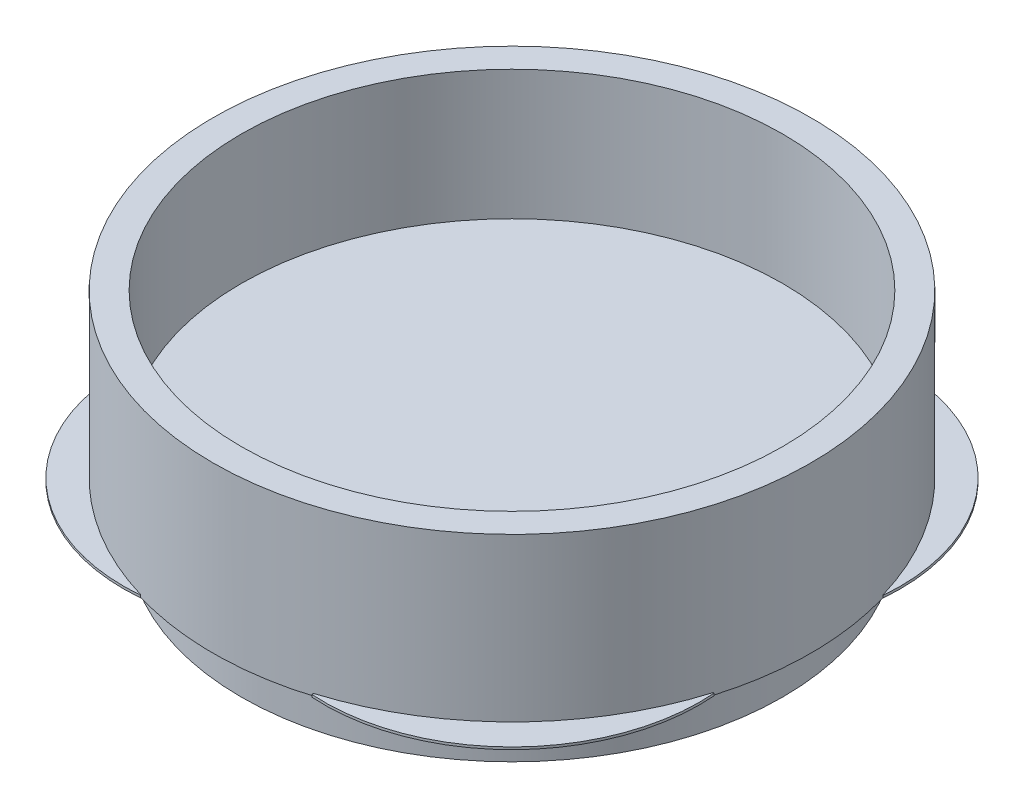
from build123d import *

# Parameters (mm, degrees)
SKETCH1_R           = 12.7
SKETCH1_R_2         = 11.5
BOSS_EXTRUDE1_DEPTH = 5.5
BOSS_EXTRUDE2_START = 1.5
SKETCH2_R           = 12.7
SKETCH2_R_2         = 11.5
SKETCH2_R_3         = 10.16
BOSS_EXTRUDE2_DEPTH = 1.5
BOSS_EXTRUDE3_START = -3.714882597
SKETCH1_2_R         = 11.5
BOSS_EXTRUDE3_DEPTH = 3.714882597
BOSS_EXTRUDE4_DEPTH = 0.1


with BuildPart() as part:
    # Sketch1 → Boss-Extrude1 (new body)
    with BuildSketch(Plane(origin=(0, 0, 0), x_dir=(1, 0, 0), z_dir=(0, 1, 0))):
        with Locations(Location((0, 0, 0), (0, 0, 270))):
            Circle(SKETCH1_R)
        with Locations(Location((0, 0, 0), (0, 0, 270))):
            Circle(SKETCH1_R_2, mode=Mode.SUBTRACT)
    extrude(amount=BOSS_EXTRUDE1_DEPTH)

    # Sketch2 → Boss-Extrude2 (add)
    # profile 1 of 2: a face of its own
    with BuildSketch(Plane.XZ.offset(BOSS_EXTRUDE2_START)):
        with Locations(Location((0, 0, 0), (0, 0, 270))):
            Circle(SKETCH2_R)
        with Locations(Location((0, 0, 0), (0, 0, 90))):
            Circle(SKETCH2_R_2, mode=Mode.SUBTRACT)
    # profile 2 of 2: a face of its own
    with BuildSketch(Plane.XZ.offset(BOSS_EXTRUDE2_START)):
        with Locations(Location((0, 0, 0), (0, 0, 90))):
            Circle(SKETCH2_R_2)
        with Locations(Location((0, 0, 0), (0, 0, 270))):
            Circle(SKETCH2_R_3, mode=Mode.SUBTRACT)
    extrude(amount=-BOSS_EXTRUDE2_DEPTH)

    # Sketch1_2 → Boss-Extrude3 (add)
    with BuildSketch(Plane(origin=(0, 0, 0), x_dir=(1, 0, 0), z_dir=(0, 1, 0)).offset(BOSS_EXTRUDE3_START)):
        with Locations(Location((0, 0, 0), (0, 0, 270))):
            Circle(SKETCH1_2_R)
    extrude(amount=BOSS_EXTRUDE3_DEPTH)

    # Sketch4 → Boss-Extrude4 (add)
    with BuildSketch(Plane.XZ.offset(1.5)):
        with BuildLine():
            Line((-4.00434757, -12.230087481), (-3.827330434, -12.109564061))
            ThreePointArc((-3.827330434, -12.109564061), (-9.044088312, -8.915966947), (-12.162934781, -3.654178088))
            Line((-12.162934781, -3.654178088), (-12.21265139, -3.668574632))
            ThreePointArc((-12.21265139, -3.668574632), (-10.017201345, -9.779288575), (-4.00434757, -12.230087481))
        make_face()
        with BuildLine():
            Line((-12.214155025, 3.689074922), (-12.140974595, 3.726491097))
            ThreePointArc((-12.140974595, 3.726491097), (-8.928205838, 9.03200645), (-3.585909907, 12.183236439))
            Line((-3.585909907, 12.183236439), (-3.577229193, 12.204761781))
            ThreePointArc((-3.577229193, 12.204761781), (-9.859759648, 9.938948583), (-12.214155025, 3.689074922))
        make_face()
        with BuildLine():
            ThreePointArc((3.712322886, 12.145314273), (9.011100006, 8.949305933), (12.170571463, 3.628662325))
            Line((12.170571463, 3.628662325), (12.209196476, 3.623974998))
            ThreePointArc((12.209196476, 3.623974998), (9.930804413, 9.868013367), (3.712322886, 12.215261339))
            Line((3.712322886, 12.215261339), (3.712322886, 12.145314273))
        make_face()
        with BuildLine():
            ThreePointArc((4.018821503, -12.230543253), (10.060247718, -9.734036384), (12.203668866, -3.558510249))
            Line((12.203668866, -3.558510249), (12.190704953, -3.560437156))
            Line((12.190704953, -3.560437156), (9.692022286, -3.048))
            ThreePointArc((9.692022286, -3.048), (7.184946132, -7.183463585), (3.05, -9.691393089))
            Line((3.05, -9.691393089), (3.712322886, -12.145314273))
            Line((3.712322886, -12.145314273), (4.018821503, -12.230543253))
        make_face()
    extrude(amount=-BOSS_EXTRUDE4_DEPTH)


solid = part.part
